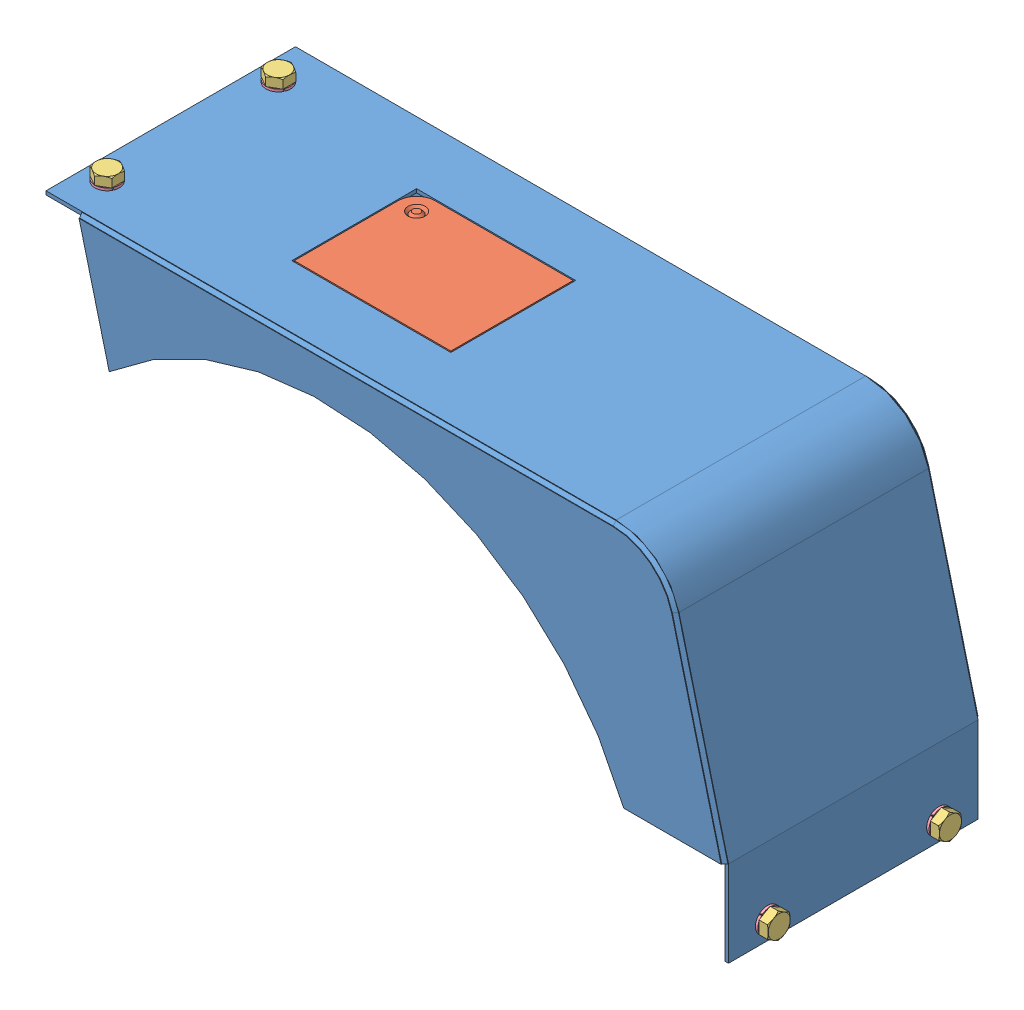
SolidWorks assembly 145 - carter central avec trappe de visite.SLDASM, configuration Default (file format 3100). Lengths in mm.
Overall size (567.5 277.5 210).
10 component instances, 4 part files, 14 mates.
Components (placement in the parent):
- 145 - carter central-1: 145 - carter central.SLDPRT [Default<Brut d'usinage>] at (100.8495 49.5118 -86.8545) size (558 268 210)
- 164 - Trappe de visite-1: 164 - Trappe de visite.SLDPRT [Default<Brut d'usinage>] at (-167.9818 102.0496 1.4705) x (1 0 0) z (0 1 0) size (166.03 138.03 40)
- VisHM12x25-1: VisHM12x25.SLDPRT [Défaut] at (-338.7434 107.0496 85.1455) x (0.5 0 0.866025) z (0 -1 0) size (18 20.78 32.5)
- Rondelle_grower W12-1: Rondelle_grower W12.SLDPRT [Défaut] at (-338.7434 105.0496 85.1455) x (0 1 0) z (0.429979 0 -0.902839) size (2 20 20)
- Rondelle_grower W12-2: Rondelle_grower W12.SLDPRT [Défaut] at (-338.7434 105.0496 -54.8545) x (0 1 0) z (0.429979 0 -0.902839) size (2 20 20)
- VisHM12x25-2: VisHM12x25.SLDPRT [Défaut] at (-338.7434 107.0496 -54.8545) x (0.5 0 0.866025) z (0 -1 0) size (18 20.78 32.5)
- VisHM12x25-3: VisHM12x25.SLDPRT [Défaut] at (203.2566 -147.9504 85.1455) x (0 0.866025 0.5) z (-1 0 0) size (18 20.78 32.5)
- Rondelle_grower W12-3: Rondelle_grower W12.SLDPRT [Défaut] at (203.2566 -147.9504 85.1455) x (-1 0 0) z (0 0.672318 -0.740262) size (2 20 20)
- Rondelle_grower W12-4: Rondelle_grower W12.SLDPRT [Défaut] at (203.2566 -147.9504 -54.8545) x (-1 0 0) z (0 0.672318 -0.740262) size (2 20 20)
- VisHM12x25-4: VisHM12x25.SLDPRT [Défaut] at (203.2566 -147.9504 -54.8545) x (0 0.866025 0.5) z (-1 0 0) size (18 20.78 32.5)
Mates (geometry in assembly coordinates):
- Répétition linéaire locale2: unknown: unknown of 145 - carter central-1
- Coïncidente1: coincident aligned: plane of 145 - carter central-1 through (-356.7434 105.0496 117.1455) normal (0 1 0); plane of 164 - Trappe de visite-1 through (-190.7434 105.0496 -19.8545) normal (0 1 0)
- Distance1: distance = 1 mm anti-aligned: plane of 145 - carter central-1 through (-76.7434 95.0496 66.1455) normal (0 0 -1); plane of 164 - Trappe de visite-1 through (-205.7434 105.0496 65.1455) normal (0 0 1)
- Distance2: distance = 1 mm anti-aligned: plane of 145 - carter central-1 through (-76.7434 95.0496 -35.8545) normal (-1 0 0); plane of 164 - Trappe de visite-1 through (-77.7434 105.0496 -34.8545) normal (1 0 0)
- Coaxiale1: concentric aligned: cylinder of VisHM12x25-1; cylinder of Rondelle_grower W12-1
- Coïncidente4: coincident anti-aligned: plane of VisHM12x25-1 through (-338.7434 107.0496 95.5378) normal (0 -1 0); plane of Rondelle_grower W12-1 through (-343.0432 107.0496 94.1739) normal (0 1 0)
- Coaxiale2: concentric anti-aligned: cylinder of 145 - carter central-1; cylinder of VisHM12x25-1
- Coïncidente5: coincident anti-aligned: plane of 145 - carter central-1 through (-356.7434 105.0496 117.1455) normal (0 1 0); plane of Rondelle_grower W12-1 through (-343.0432 105.0496 94.1739) normal (0 -1 0)
- Parallèle1: parallel aligned: plane of 145 - carter central-1 through (-356.7434 105.0496 117.1455) normal (-1 0 0); plane of VisHM12x25-1 through (-347.7434 114.5496 79.9494) normal (-1 0 0)
- Coaxiale3: concentric anti-aligned: cylinder of VisHM12x25-3; cylinder of Rondelle_grower W12-3
- Coïncidente7: coincident anti-aligned: plane of VisHM12x25-3 through (203.2566 -137.5581 85.1455) normal (-1 0 0); plane of Rondelle_grower W12-3 through (203.2566 -154.6736 92.5481) normal (1 0 0)
- Coaxiale4: concentric anti-aligned: cylinder of 145 - carter central-1; cylinder of VisHM12x25-3
- Coïncidente8: coincident anti-aligned: plane of 145 - carter central-1 through (201.2566 -92.5719 117.1455) normal (1 0 0); plane of Rondelle_grower W12-3 through (201.2566 -154.6736 92.5481) normal (-1 0 0)
- Parallèle2: parallel aligned: plane of 145 - carter central-1 through (109.4596 52.0496 117.1455) normal (0 0 1); plane of VisHM12x25-3 through (210.7566 -153.1465 94.1455) normal (0 0 1)
